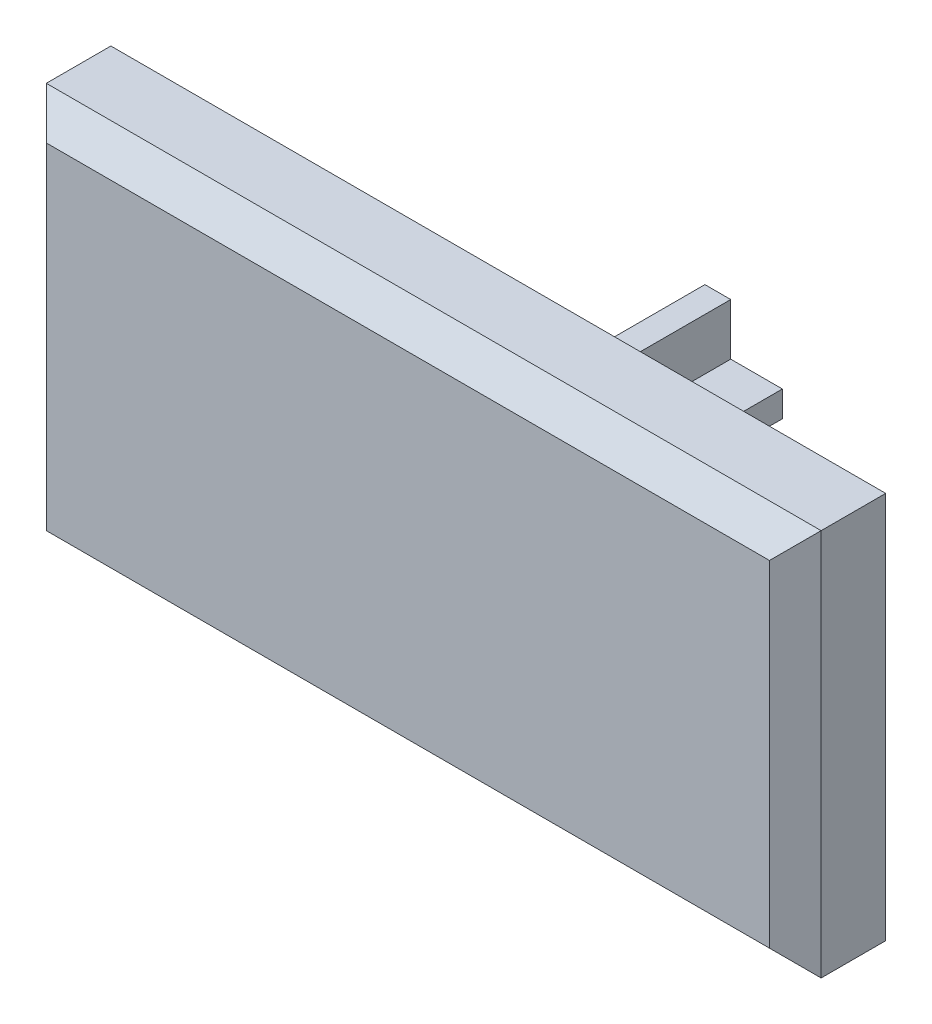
ISO-10303-21;
HEADER;
FILE_DESCRIPTION(('STEP AP214'),'2;1');
FILE_NAME('part.step','',(''),(''),'','','');
FILE_SCHEMA(('AUTOMOTIVE_DESIGN { 1 0 10303 214 1 1 1 1 }'));
ENDSEC;
DATA;
#1=APPLICATION_CONTEXT('core data for automotive mechanical design processes');
#2=APPLICATION_PROTOCOL_DEFINITION('international standard','automotive_design',2000,#1);
#3=PRODUCT_CONTEXT('',#1,'mechanical');
#4=PRODUCT('Part','Part','',(#3));
#5=PRODUCT_RELATED_PRODUCT_CATEGORY('part','',(#4));
#6=PRODUCT_DEFINITION_FORMATION('','',#4);
#7=PRODUCT_DEFINITION_CONTEXT('part definition',#1,'design');
#8=PRODUCT_DEFINITION('design','',#6,#7);
#9=PRODUCT_DEFINITION_SHAPE('','',#8);
#10=(LENGTH_UNIT() NAMED_UNIT(*) SI_UNIT(.MILLI.,.METRE.));
#11=(NAMED_UNIT(*) PLANE_ANGLE_UNIT() SI_UNIT($,.RADIAN.));
#12=(NAMED_UNIT(*) SI_UNIT($,.STERADIAN.) SOLID_ANGLE_UNIT());
#13=UNCERTAINTY_MEASURE_WITH_UNIT(LENGTH_MEASURE(1.E-05),#10,'distance_accuracy_value','');
#14=(GEOMETRIC_REPRESENTATION_CONTEXT(3) GLOBAL_UNCERTAINTY_ASSIGNED_CONTEXT((#13)) GLOBAL_UNIT_ASSIGNED_CONTEXT((#10,
#11,#12)) REPRESENTATION_CONTEXT('',''));
#15=CARTESIAN_POINT('',(0.,0.,0.));
#16=DIRECTION('',(0.,0.,1.));
#17=DIRECTION('',(1.,0.,0.));
#18=AXIS2_PLACEMENT_3D('',#15,#16,#17);
#19=CARTESIAN_POINT('',(0.,0.,-0.25));
#20=DIRECTION('',(0.,0.,1.));
#21=DIRECTION('',(1.,0.,0.));
#22=AXIS2_PLACEMENT_3D('',#19,#20,#21);
#23=PLANE('',#22);
#24=DIRECTION('',(0.,-1.,0.));
#25=VECTOR('',#24,1.);
#26=CARTESIAN_POINT('',(-13.,7.5,-0.25));
#27=LINE('',#26,#25);
#28=CARTESIAN_POINT('',(-13.,5.5,-0.25));
#29=VERTEX_POINT('',#28);
#30=CARTESIAN_POINT('',(-13.,-5.5,-0.25));
#31=VERTEX_POINT('',#30);
#32=EDGE_CURVE('E217',#29,#31,#27,.T.);
#33=ORIENTED_EDGE('',*,*,#32,.F.);
#34=DIRECTION('',(-1.,0.,0.));
#35=VECTOR('',#34,1.);
#36=CARTESIAN_POINT('',(-15.,5.5,-0.25));
#37=LINE('',#36,#35);
#38=CARTESIAN_POINT('',(13.,5.5,-0.25));
#39=VERTEX_POINT('',#38);
#40=EDGE_CURVE('E225',#39,#29,#37,.T.);
#41=ORIENTED_EDGE('',*,*,#40,.F.);
#42=DIRECTION('',(0.,1.,0.));
#43=VECTOR('',#42,1.);
#44=CARTESIAN_POINT('',(13.,7.5,-0.25));
#45=LINE('',#44,#43);
#46=CARTESIAN_POINT('',(13.,-5.5,-0.25));
#47=VERTEX_POINT('',#46);
#48=EDGE_CURVE('E229',#47,#39,#45,.T.);
#49=ORIENTED_EDGE('',*,*,#48,.F.);
#50=DIRECTION('',(1.,0.,0.));
#51=VECTOR('',#50,1.);
#52=CARTESIAN_POINT('',(-15.,-5.5,-0.25));
#53=LINE('',#52,#51);
#54=EDGE_CURVE('E220',#31,#47,#53,.T.);
#55=ORIENTED_EDGE('',*,*,#54,.F.);
#56=EDGE_LOOP('',(#33,#41,#49,#55));
#57=FACE_BOUND('',#56,.T.);
#58=DIRECTION('',(0.,-1.,0.));
#59=VECTOR('',#58,1.);
#60=CARTESIAN_POINT('',(2.5,0.5,-0.25));
#61=LINE('',#60,#59);
#62=CARTESIAN_POINT('',(2.5,0.5,-0.25));
#63=VERTEX_POINT('',#62);
#64=CARTESIAN_POINT('',(2.5,-0.5,-0.25));
#65=VERTEX_POINT('',#64);
#66=EDGE_CURVE('E203',#63,#65,#61,.T.);
#67=ORIENTED_EDGE('',*,*,#66,.F.);
#68=DIRECTION('',(1.,0.,0.));
#69=VECTOR('',#68,1.);
#70=CARTESIAN_POINT('',(2.5,0.5,-0.25));
#71=LINE('',#70,#69);
#72=CARTESIAN_POINT('',(0.5,0.5,-0.25));
#73=VERTEX_POINT('',#72);
#74=EDGE_CURVE('E200',#73,#63,#71,.T.);
#75=ORIENTED_EDGE('',*,*,#74,.F.);
#76=DIRECTION('',(0.,-1.,0.));
#77=VECTOR('',#76,1.);
#78=CARTESIAN_POINT('',(0.5,2.5,-0.25));
#79=LINE('',#78,#77);
#80=CARTESIAN_POINT('',(0.5,2.5,-0.25));
#81=VERTEX_POINT('',#80);
#82=EDGE_CURVE('E579',#81,#73,#79,.T.);
#83=ORIENTED_EDGE('',*,*,#82,.F.);
#84=DIRECTION('',(1.,0.,0.));
#85=VECTOR('',#84,1.);
#86=CARTESIAN_POINT('',(0.5,2.5,-0.25));
#87=LINE('',#86,#85);
#88=CARTESIAN_POINT('',(-0.5,2.5,-0.25));
#89=VERTEX_POINT('',#88);
#90=EDGE_CURVE('E634',#89,#81,#87,.T.);
#91=ORIENTED_EDGE('',*,*,#90,.F.);
#92=DIRECTION('',(0.,1.,0.));
#93=VECTOR('',#92,1.);
#94=CARTESIAN_POINT('',(-0.5,2.5,-0.25));
#95=LINE('',#94,#93);
#96=CARTESIAN_POINT('',(-0.5,0.5,-0.25));
#97=VERTEX_POINT('',#96);
#98=EDGE_CURVE('E631',#97,#89,#95,.T.);
#99=ORIENTED_EDGE('',*,*,#98,.F.);
#100=DIRECTION('',(1.,0.,0.));
#101=VECTOR('',#100,1.);
#102=CARTESIAN_POINT('',(-0.5,0.5,-0.25));
#103=LINE('',#102,#101);
#104=CARTESIAN_POINT('',(-2.5,0.5,-0.25));
#105=VERTEX_POINT('',#104);
#106=EDGE_CURVE('E628',#105,#97,#103,.T.);
#107=ORIENTED_EDGE('',*,*,#106,.F.);
#108=DIRECTION('',(0.,1.,0.));
#109=VECTOR('',#108,1.);
#110=CARTESIAN_POINT('',(-2.5,0.5,-0.25));
#111=LINE('',#110,#109);
#112=CARTESIAN_POINT('',(-2.5,-0.5,-0.25));
#113=VERTEX_POINT('',#112);
#114=EDGE_CURVE('E625',#113,#105,#111,.T.);
#115=ORIENTED_EDGE('',*,*,#114,.F.);
#116=DIRECTION('',(-1.,0.,0.));
#117=VECTOR('',#116,1.);
#118=CARTESIAN_POINT('',(-0.5,-0.5,-0.25));
#119=LINE('',#118,#117);
#120=CARTESIAN_POINT('',(-0.5,-0.5,-0.25));
#121=VERTEX_POINT('',#120);
#122=EDGE_CURVE('E622',#121,#113,#119,.T.);
#123=ORIENTED_EDGE('',*,*,#122,.F.);
#124=DIRECTION('',(0.,1.,0.));
#125=VECTOR('',#124,1.);
#126=CARTESIAN_POINT('',(-0.5,-0.5,-0.25));
#127=LINE('',#126,#125);
#128=CARTESIAN_POINT('',(-0.5,-2.5,-0.25));
#129=VERTEX_POINT('',#128);
#130=EDGE_CURVE('E615',#129,#121,#127,.T.);
#131=ORIENTED_EDGE('',*,*,#130,.F.);
#132=DIRECTION('',(-1.,0.,0.));
#133=VECTOR('',#132,1.);
#134=CARTESIAN_POINT('',(0.5,-2.5,-0.25));
#135=LINE('',#134,#133);
#136=CARTESIAN_POINT('',(0.5,-2.5,-0.25));
#137=VERTEX_POINT('',#136);
#138=EDGE_CURVE('E612',#137,#129,#135,.T.);
#139=ORIENTED_EDGE('',*,*,#138,.F.);
#140=DIRECTION('',(0.,-1.,0.));
#141=VECTOR('',#140,1.);
#142=CARTESIAN_POINT('',(0.5,-0.5,-0.25));
#143=LINE('',#142,#141);
#144=CARTESIAN_POINT('',(0.5,-0.5,-0.25));
#145=VERTEX_POINT('',#144);
#146=EDGE_CURVE('E55',#145,#137,#143,.T.);
#147=ORIENTED_EDGE('',*,*,#146,.F.);
#148=DIRECTION('',(-1.,0.,0.));
#149=VECTOR('',#148,1.);
#150=CARTESIAN_POINT('',(2.5,-0.5,-0.25));
#151=LINE('',#150,#149);
#152=EDGE_CURVE('E50',#65,#145,#151,.T.);
#153=ORIENTED_EDGE('',*,*,#152,.F.);
#154=EDGE_LOOP('',(#67,#75,#83,#91,#99,#107,#115,#123,#131,#139,#147,#153));
#155=FACE_BOUND('',#154,.T.);
#156=ADVANCED_FACE('F33',(#57,#155),#23,.F.);
#157=CARTESIAN_POINT('',(-15.,7.5,1.75));
#158=DIRECTION('',(1.,0.,0.));
#159=DIRECTION('',(0.,1.,0.));
#160=AXIS2_PLACEMENT_3D('',#157,#158,#159);
#161=PLANE('',#160);
#162=DIRECTION('',(0.,0.,-1.));
#163=VECTOR('',#162,1.);
#164=CARTESIAN_POINT('',(-15.,-7.5,1.75));
#165=LINE('',#164,#163);
#166=CARTESIAN_POINT('',(-15.,-7.5,0.749999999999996));
#167=VERTEX_POINT('',#166);
#168=CARTESIAN_POINT('',(-15.,-7.5,-1.75));
#169=VERTEX_POINT('',#168);
#170=EDGE_CURVE('E261',#167,#169,#165,.T.);
#171=ORIENTED_EDGE('',*,*,#170,.F.);
#172=DIRECTION('',(0.,1.,0.));
#173=VECTOR('',#172,1.);
#174=CARTESIAN_POINT('',(-15.,7.5,0.749999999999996));
#175=LINE('',#174,#173);
#176=CARTESIAN_POINT('',(-15.,7.5,0.749999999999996));
#177=VERTEX_POINT('',#176);
#178=EDGE_CURVE('E42',#167,#177,#175,.T.);
#179=ORIENTED_EDGE('',*,*,#178,.T.);
#180=DIRECTION('',(0.,0.,-1.));
#181=VECTOR('',#180,1.);
#182=CARTESIAN_POINT('',(-15.,7.5,1.75));
#183=LINE('',#182,#181);
#184=CARTESIAN_POINT('',(-15.,7.5,-1.75));
#185=VERTEX_POINT('',#184);
#186=EDGE_CURVE('E255',#177,#185,#183,.T.);
#187=ORIENTED_EDGE('',*,*,#186,.T.);
#188=DIRECTION('',(0.,-1.,0.));
#189=VECTOR('',#188,1.);
#190=CARTESIAN_POINT('',(-15.,7.5,-1.75));
#191=LINE('',#190,#189);
#192=EDGE_CURVE('E215',#185,#169,#191,.T.);
#193=ORIENTED_EDGE('',*,*,#192,.T.);
#194=EDGE_LOOP('',(#171,#179,#187,#193));
#195=FACE_BOUND('',#194,.T.);
#196=ADVANCED_FACE('F297',(#195),#161,.F.);
#197=CARTESIAN_POINT('',(-15.,-7.5,1.75));
#198=DIRECTION('',(0.,1.,0.));
#199=DIRECTION('',(0.,0.,1.));
#200=AXIS2_PLACEMENT_3D('',#197,#198,#199);
#201=PLANE('',#200);
#202=DIRECTION('',(0.,0.,-1.));
#203=VECTOR('',#202,1.);
#204=CARTESIAN_POINT('',(15.,-7.5,1.75));
#205=LINE('',#204,#203);
#206=CARTESIAN_POINT('',(15.,-7.5,0.749999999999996));
#207=VERTEX_POINT('',#206);
#208=CARTESIAN_POINT('',(15.,-7.5,-1.75));
#209=VERTEX_POINT('',#208);
#210=EDGE_CURVE('E259',#207,#209,#205,.T.);
#211=ORIENTED_EDGE('',*,*,#210,.F.);
#212=DIRECTION('',(-1.,0.,0.));
#213=VECTOR('',#212,1.);
#214=CARTESIAN_POINT('',(-15.,-7.5,0.749999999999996));
#215=LINE('',#214,#213);
#216=EDGE_CURVE('E275',#207,#167,#215,.T.);
#217=ORIENTED_EDGE('',*,*,#216,.T.);
#218=ORIENTED_EDGE('',*,*,#170,.T.);
#219=DIRECTION('',(1.,0.,0.));
#220=VECTOR('',#219,1.);
#221=CARTESIAN_POINT('',(-15.,-7.5,-1.75));
#222=LINE('',#221,#220);
#223=EDGE_CURVE('E246',#169,#209,#222,.T.);
#224=ORIENTED_EDGE('',*,*,#223,.T.);
#225=EDGE_LOOP('',(#211,#217,#218,#224));
#226=FACE_BOUND('',#225,.T.);
#227=ADVANCED_FACE('F309',(#226),#201,.F.);
#228=CARTESIAN_POINT('',(15.,7.5,1.75));
#229=DIRECTION('',(-1.,0.,0.));
#230=DIRECTION('',(0.,-1.,0.));
#231=AXIS2_PLACEMENT_3D('',#228,#229,#230);
#232=PLANE('',#231);
#233=DIRECTION('',(0.,0.,-1.));
#234=VECTOR('',#233,1.);
#235=CARTESIAN_POINT('',(15.,7.5,1.75));
#236=LINE('',#235,#234);
#237=CARTESIAN_POINT('',(15.,7.5,0.749999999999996));
#238=VERTEX_POINT('',#237);
#239=CARTESIAN_POINT('',(15.,7.5,-1.75));
#240=VERTEX_POINT('',#239);
#241=EDGE_CURVE('E257',#238,#240,#236,.T.);
#242=ORIENTED_EDGE('',*,*,#241,.F.);
#243=DIRECTION('',(0.,-1.,0.));
#244=VECTOR('',#243,1.);
#245=CARTESIAN_POINT('',(15.,-7.5,0.749999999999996));
#246=LINE('',#245,#244);
#247=EDGE_CURVE('E272',#238,#207,#246,.T.);
#248=ORIENTED_EDGE('',*,*,#247,.T.);
#249=ORIENTED_EDGE('',*,*,#210,.T.);
#250=DIRECTION('',(0.,1.,0.));
#251=VECTOR('',#250,1.);
#252=CARTESIAN_POINT('',(15.,7.5,-1.75));
#253=LINE('',#252,#251);
#254=EDGE_CURVE('E249',#209,#240,#253,.T.);
#255=ORIENTED_EDGE('',*,*,#254,.T.);
#256=EDGE_LOOP('',(#242,#248,#249,#255));
#257=FACE_BOUND('',#256,.T.);
#258=ADVANCED_FACE('F311',(#257),#232,.F.);
#259=CARTESIAN_POINT('',(-15.,7.5,1.75));
#260=DIRECTION('',(0.,-1.,0.));
#261=DIRECTION('',(1.,0.,0.));
#262=AXIS2_PLACEMENT_3D('',#259,#260,#261);
#263=PLANE('',#262);
#264=ORIENTED_EDGE('',*,*,#186,.F.);
#265=DIRECTION('',(1.,0.,0.));
#266=VECTOR('',#265,1.);
#267=CARTESIAN_POINT('',(15.,7.5,0.749999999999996));
#268=LINE('',#267,#266);
#269=EDGE_CURVE('E11',#177,#238,#268,.T.);
#270=ORIENTED_EDGE('',*,*,#269,.T.);
#271=ORIENTED_EDGE('',*,*,#241,.T.);
#272=DIRECTION('',(-1.,0.,0.));
#273=VECTOR('',#272,1.);
#274=CARTESIAN_POINT('',(-15.,7.5,-1.75));
#275=LINE('',#274,#273);
#276=EDGE_CURVE('E252',#240,#185,#275,.T.);
#277=ORIENTED_EDGE('',*,*,#276,.T.);
#278=EDGE_LOOP('',(#264,#270,#271,#277));
#279=FACE_BOUND('',#278,.T.);
#280=ADVANCED_FACE('F299',(#279),#263,.F.);
#281=CARTESIAN_POINT('',(0.,0.,1.75));
#282=DIRECTION('',(0.,0.,1.));
#283=DIRECTION('',(1.,0.,0.));
#284=AXIS2_PLACEMENT_3D('',#281,#282,#283);
#285=PLANE('',#284);
#286=DIRECTION('',(1.,0.,0.));
#287=VECTOR('',#286,1.);
#288=CARTESIAN_POINT('',(15.,-6.5,1.75));
#289=LINE('',#288,#287);
#290=CARTESIAN_POINT('',(-14.,-6.5,1.75));
#291=VERTEX_POINT('',#290);
#292=CARTESIAN_POINT('',(14.,-6.5,1.75));
#293=VERTEX_POINT('',#292);
#294=EDGE_CURVE('E267',#291,#293,#289,.T.);
#295=ORIENTED_EDGE('',*,*,#294,.T.);
#296=DIRECTION('',(0.,1.,0.));
#297=VECTOR('',#296,1.);
#298=CARTESIAN_POINT('',(14.,7.5,1.75));
#299=LINE('',#298,#297);
#300=CARTESIAN_POINT('',(14.,6.5,1.75));
#301=VERTEX_POINT('',#300);
#302=EDGE_CURVE('E269',#293,#301,#299,.T.);
#303=ORIENTED_EDGE('',*,*,#302,.T.);
#304=DIRECTION('',(-1.,0.,0.));
#305=VECTOR('',#304,1.);
#306=CARTESIAN_POINT('',(-15.,6.5,1.75));
#307=LINE('',#306,#305);
#308=CARTESIAN_POINT('',(-14.,6.5,1.75));
#309=VERTEX_POINT('',#308);
#310=EDGE_CURVE('E263',#301,#309,#307,.T.);
#311=ORIENTED_EDGE('',*,*,#310,.T.);
#312=DIRECTION('',(0.,-1.,0.));
#313=VECTOR('',#312,1.);
#314=CARTESIAN_POINT('',(-14.,-7.5,1.75));
#315=LINE('',#314,#313);
#316=EDGE_CURVE('E265',#309,#291,#315,.T.);
#317=ORIENTED_EDGE('',*,*,#316,.T.);
#318=EDGE_LOOP('',(#295,#303,#311,#317));
#319=FACE_BOUND('',#318,.T.);
#320=ADVANCED_FACE('F319',(#319),#285,.T.);
#321=CARTESIAN_POINT('',(0.,0.,-1.75));
#322=DIRECTION('',(0.,0.,1.));
#323=DIRECTION('',(1.,0.,0.));
#324=AXIS2_PLACEMENT_3D('',#321,#322,#323);
#325=PLANE('',#324);
#326=DIRECTION('',(-1.,0.,0.));
#327=VECTOR('',#326,1.);
#328=CARTESIAN_POINT('',(-15.,5.5,-1.75));
#329=LINE('',#328,#327);
#330=CARTESIAN_POINT('',(13.,5.5,-1.75));
#331=VERTEX_POINT('',#330);
#332=CARTESIAN_POINT('',(-13.,5.5,-1.75));
#333=VERTEX_POINT('',#332);
#334=EDGE_CURVE('E221',#331,#333,#329,.T.);
#335=ORIENTED_EDGE('',*,*,#334,.T.);
#336=DIRECTION('',(0.,-1.,0.));
#337=VECTOR('',#336,1.);
#338=CARTESIAN_POINT('',(-13.,7.5,-1.75));
#339=LINE('',#338,#337);
#340=CARTESIAN_POINT('',(-13.,-5.5,-1.75));
#341=VERTEX_POINT('',#340);
#342=EDGE_CURVE('E233',#333,#341,#339,.T.);
#343=ORIENTED_EDGE('',*,*,#342,.T.);
#344=DIRECTION('',(1.,0.,0.));
#345=VECTOR('',#344,1.);
#346=CARTESIAN_POINT('',(-15.,-5.5,-1.75));
#347=LINE('',#346,#345);
#348=CARTESIAN_POINT('',(13.,-5.5,-1.75));
#349=VERTEX_POINT('',#348);
#350=EDGE_CURVE('E236',#341,#349,#347,.T.);
#351=ORIENTED_EDGE('',*,*,#350,.T.);
#352=DIRECTION('',(0.,1.,0.));
#353=VECTOR('',#352,1.);
#354=CARTESIAN_POINT('',(13.,7.5,-1.75));
#355=LINE('',#354,#353);
#356=EDGE_CURVE('E239',#349,#331,#355,.T.);
#357=ORIENTED_EDGE('',*,*,#356,.T.);
#358=EDGE_LOOP('',(#335,#343,#351,#357));
#359=FACE_BOUND('',#358,.T.);
#360=ORIENTED_EDGE('',*,*,#192,.F.);
#361=ORIENTED_EDGE('',*,*,#276,.F.);
#362=ORIENTED_EDGE('',*,*,#254,.F.);
#363=ORIENTED_EDGE('',*,*,#223,.F.);
#364=EDGE_LOOP('',(#360,#361,#362,#363));
#365=FACE_BOUND('',#364,.T.);
#366=ADVANCED_FACE('F306',(#359,#365),#325,.F.);
#367=CARTESIAN_POINT('',(-13.,7.5,1.75));
#368=DIRECTION('',(1.,0.,0.));
#369=DIRECTION('',(0.,1.,0.));
#370=AXIS2_PLACEMENT_3D('',#367,#368,#369);
#371=PLANE('',#370);
#372=ORIENTED_EDGE('',*,*,#342,.F.);
#373=DIRECTION('',(0.,0.,-1.));
#374=VECTOR('',#373,1.);
#375=CARTESIAN_POINT('',(-13.,5.5,1.75));
#376=LINE('',#375,#374);
#377=EDGE_CURVE('E222',#29,#333,#376,.T.);
#378=ORIENTED_EDGE('',*,*,#377,.F.);
#379=ORIENTED_EDGE('',*,*,#32,.T.);
#380=DIRECTION('',(0.,0.,-1.));
#381=VECTOR('',#380,1.);
#382=CARTESIAN_POINT('',(-13.,-5.5,1.75));
#383=LINE('',#382,#381);
#384=EDGE_CURVE('E212',#31,#341,#383,.T.);
#385=ORIENTED_EDGE('',*,*,#384,.T.);
#386=EDGE_LOOP('',(#372,#378,#379,#385));
#387=FACE_BOUND('',#386,.T.);
#388=ADVANCED_FACE('F326',(#387),#371,.T.);
#389=CARTESIAN_POINT('',(-15.,-5.5,1.75));
#390=DIRECTION('',(0.,1.,0.));
#391=DIRECTION('',(0.,0.,1.));
#392=AXIS2_PLACEMENT_3D('',#389,#390,#391);
#393=PLANE('',#392);
#394=ORIENTED_EDGE('',*,*,#350,.F.);
#395=ORIENTED_EDGE('',*,*,#384,.F.);
#396=ORIENTED_EDGE('',*,*,#54,.T.);
#397=DIRECTION('',(0.,0.,-1.));
#398=VECTOR('',#397,1.);
#399=CARTESIAN_POINT('',(13.,-5.5,1.75));
#400=LINE('',#399,#398);
#401=EDGE_CURVE('E216',#47,#349,#400,.T.);
#402=ORIENTED_EDGE('',*,*,#401,.T.);
#403=EDGE_LOOP('',(#394,#395,#396,#402));
#404=FACE_BOUND('',#403,.T.);
#405=ADVANCED_FACE('F346',(#404),#393,.T.);
#406=CARTESIAN_POINT('',(13.,7.5,1.75));
#407=DIRECTION('',(-1.,0.,0.));
#408=DIRECTION('',(0.,-1.,0.));
#409=AXIS2_PLACEMENT_3D('',#406,#407,#408);
#410=PLANE('',#409);
#411=ORIENTED_EDGE('',*,*,#356,.F.);
#412=ORIENTED_EDGE('',*,*,#401,.F.);
#413=ORIENTED_EDGE('',*,*,#48,.T.);
#414=DIRECTION('',(0.,0.,-1.));
#415=VECTOR('',#414,1.);
#416=CARTESIAN_POINT('',(13.,5.5,1.75));
#417=LINE('',#416,#415);
#418=EDGE_CURVE('E224',#39,#331,#417,.T.);
#419=ORIENTED_EDGE('',*,*,#418,.T.);
#420=EDGE_LOOP('',(#411,#412,#413,#419));
#421=FACE_BOUND('',#420,.T.);
#422=ADVANCED_FACE('F342',(#421),#410,.T.);
#423=CARTESIAN_POINT('',(-15.,5.5,1.75));
#424=DIRECTION('',(0.,-1.,0.));
#425=DIRECTION('',(1.,0.,0.));
#426=AXIS2_PLACEMENT_3D('',#423,#424,#425);
#427=PLANE('',#426);
#428=ORIENTED_EDGE('',*,*,#334,.F.);
#429=ORIENTED_EDGE('',*,*,#418,.F.);
#430=ORIENTED_EDGE('',*,*,#40,.T.);
#431=ORIENTED_EDGE('',*,*,#377,.T.);
#432=EDGE_LOOP('',(#428,#429,#430,#431));
#433=FACE_BOUND('',#432,.T.);
#434=ADVANCED_FACE('F339',(#433),#427,.T.);
#435=CARTESIAN_POINT('',(-14.,0.,1.75));
#436=DIRECTION('',(-0.707106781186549,0.,0.707106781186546));
#437=DIRECTION('',(0.,1.,0.));
#438=AXIS2_PLACEMENT_3D('',#435,#436,#437);
#439=PLANE('',#438);
#440=DIRECTION('',(0.577350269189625,-0.577350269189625,0.577350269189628));
#441=VECTOR('',#440,1.);
#442=CARTESIAN_POINT('',(-9.33333333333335,1.83333333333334,6.41666666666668));
#443=LINE('',#442,#441);
#444=EDGE_CURVE('E278',#177,#309,#443,.T.);
#445=ORIENTED_EDGE('',*,*,#444,.F.);
#446=ORIENTED_EDGE('',*,*,#178,.F.);
#447=DIRECTION('',(0.577350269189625,0.577350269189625,0.577350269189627));
#448=VECTOR('',#447,1.);
#449=CARTESIAN_POINT('',(-11.8333333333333,-4.33333333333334,3.91666666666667));
#450=LINE('',#449,#448);
#451=EDGE_CURVE('E37',#291,#167,#450,.F.);
#452=ORIENTED_EDGE('',*,*,#451,.F.);
#453=ORIENTED_EDGE('',*,*,#316,.F.);
#454=EDGE_LOOP('',(#445,#446,#452,#453));
#455=FACE_BOUND('',#454,.T.);
#456=ADVANCED_FACE('F35',(#455),#439,.T.);
#457=CARTESIAN_POINT('',(0.,-6.5,1.75));
#458=DIRECTION('',(0.,-0.707106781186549,0.707106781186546));
#459=DIRECTION('',(-1.,0.,0.));
#460=AXIS2_PLACEMENT_3D('',#457,#458,#459);
#461=PLANE('',#460);
#462=ORIENTED_EDGE('',*,*,#451,.T.);
#463=ORIENTED_EDGE('',*,*,#216,.F.);
#464=DIRECTION('',(-0.577350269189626,0.577350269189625,0.577350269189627));
#465=VECTOR('',#464,1.);
#466=CARTESIAN_POINT('',(9.33333333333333,-1.83333333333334,6.41666666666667));
#467=LINE('',#466,#465);
#468=EDGE_CURVE('E206',#293,#207,#467,.F.);
#469=ORIENTED_EDGE('',*,*,#468,.F.);
#470=ORIENTED_EDGE('',*,*,#294,.F.);
#471=EDGE_LOOP('',(#462,#463,#469,#470));
#472=FACE_BOUND('',#471,.T.);
#473=ADVANCED_FACE('F289',(#472),#461,.T.);
#474=CARTESIAN_POINT('',(0.,6.5,1.75));
#475=DIRECTION('',(0.,0.707106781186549,0.707106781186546));
#476=DIRECTION('',(1.,0.,0.));
#477=AXIS2_PLACEMENT_3D('',#474,#475,#476);
#478=PLANE('',#477);
#479=ORIENTED_EDGE('',*,*,#444,.T.);
#480=ORIENTED_EDGE('',*,*,#310,.F.);
#481=DIRECTION('',(0.577350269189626,0.577350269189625,-0.577350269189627));
#482=VECTOR('',#481,1.);
#483=CARTESIAN_POINT('',(9.33333333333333,1.83333333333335,6.41666666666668));
#484=LINE('',#483,#482);
#485=EDGE_CURVE('E204',#238,#301,#484,.F.);
#486=ORIENTED_EDGE('',*,*,#485,.F.);
#487=ORIENTED_EDGE('',*,*,#269,.F.);
#488=EDGE_LOOP('',(#479,#480,#486,#487));
#489=FACE_BOUND('',#488,.T.);
#490=ADVANCED_FACE('F317',(#489),#478,.T.);
#491=CARTESIAN_POINT('',(14.,0.,1.75));
#492=DIRECTION('',(0.707106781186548,0.,0.707106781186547));
#493=DIRECTION('',(0.,-1.,0.));
#494=AXIS2_PLACEMENT_3D('',#491,#492,#493);
#495=PLANE('',#494);
#496=ORIENTED_EDGE('',*,*,#468,.T.);
#497=ORIENTED_EDGE('',*,*,#247,.F.);
#498=ORIENTED_EDGE('',*,*,#485,.T.);
#499=ORIENTED_EDGE('',*,*,#302,.F.);
#500=EDGE_LOOP('',(#496,#497,#498,#499));
#501=FACE_BOUND('',#500,.T.);
#502=ADVANCED_FACE('F315',(#501),#495,.T.);
#503=CARTESIAN_POINT('',(2.5,0.5,-10.25));
#504=DIRECTION('',(-1.,0.,0.));
#505=DIRECTION('',(0.,0.,1.));
#506=AXIS2_PLACEMENT_3D('',#503,#504,#505);
#507=PLANE('',#506);
#508=ORIENTED_EDGE('',*,*,#66,.T.);
#509=DIRECTION('',(0.,0.,1.));
#510=VECTOR('',#509,1.);
#511=CARTESIAN_POINT('',(2.5,-0.5,-10.25));
#512=LINE('',#511,#510);
#513=CARTESIAN_POINT('',(2.5,-0.5,-10.25));
#514=VERTEX_POINT('',#513);
#515=EDGE_CURVE('E184',#514,#65,#512,.T.);
#516=ORIENTED_EDGE('',*,*,#515,.F.);
#517=DIRECTION('',(0.,-1.,0.));
#518=VECTOR('',#517,1.);
#519=CARTESIAN_POINT('',(2.5,0.5,-10.25));
#520=LINE('',#519,#518);
#521=CARTESIAN_POINT('',(2.5,0.5,-10.25));
#522=VERTEX_POINT('',#521);
#523=EDGE_CURVE('E191',#522,#514,#520,.T.);
#524=ORIENTED_EDGE('',*,*,#523,.F.);
#525=DIRECTION('',(0.,0.,1.));
#526=VECTOR('',#525,1.);
#527=CARTESIAN_POINT('',(2.5,0.5,-10.25));
#528=LINE('',#527,#526);
#529=EDGE_CURVE('E575',#522,#63,#528,.T.);
#530=ORIENTED_EDGE('',*,*,#529,.T.);
#531=EDGE_LOOP('',(#508,#516,#524,#530));
#532=FACE_BOUND('',#531,.T.);
#533=ADVANCED_FACE('F202',(#532),#507,.F.);
#534=CARTESIAN_POINT('',(2.5,-0.5,-10.25));
#535=DIRECTION('',(0.,1.,0.));
#536=DIRECTION('',(0.,0.,1.));
#537=AXIS2_PLACEMENT_3D('',#534,#535,#536);
#538=PLANE('',#537);
#539=ORIENTED_EDGE('',*,*,#152,.T.);
#540=DIRECTION('',(0.,0.,1.));
#541=VECTOR('',#540,1.);
#542=CARTESIAN_POINT('',(0.5,-0.5,-10.25));
#543=LINE('',#542,#541);
#544=CARTESIAN_POINT('',(0.5,-0.5,-10.25));
#545=VERTEX_POINT('',#544);
#546=EDGE_CURVE('E187',#545,#145,#543,.T.);
#547=ORIENTED_EDGE('',*,*,#546,.F.);
#548=DIRECTION('',(-1.,0.,0.));
#549=VECTOR('',#548,1.);
#550=CARTESIAN_POINT('',(2.5,-0.5,-10.25));
#551=LINE('',#550,#549);
#552=EDGE_CURVE('E180',#514,#545,#551,.T.);
#553=ORIENTED_EDGE('',*,*,#552,.F.);
#554=ORIENTED_EDGE('',*,*,#515,.T.);
#555=EDGE_LOOP('',(#539,#547,#553,#554));
#556=FACE_BOUND('',#555,.T.);
#557=ADVANCED_FACE('F182',(#556),#538,.F.);
#558=CARTESIAN_POINT('',(0.5,-0.5,-10.25));
#559=DIRECTION('',(-1.,0.,0.));
#560=DIRECTION('',(0.,-1.,0.));
#561=AXIS2_PLACEMENT_3D('',#558,#559,#560);
#562=PLANE('',#561);
#563=ORIENTED_EDGE('',*,*,#146,.T.);
#564=DIRECTION('',(0.,0.,1.));
#565=VECTOR('',#564,1.);
#566=CARTESIAN_POINT('',(0.5,-2.5,-10.25));
#567=LINE('',#566,#565);
#568=CARTESIAN_POINT('',(0.5,-2.5,-10.25));
#569=VERTEX_POINT('',#568);
#570=EDGE_CURVE('E208',#569,#137,#567,.T.);
#571=ORIENTED_EDGE('',*,*,#570,.F.);
#572=DIRECTION('',(0.,-1.,0.));
#573=VECTOR('',#572,1.);
#574=CARTESIAN_POINT('',(0.5,-0.5,-10.25));
#575=LINE('',#574,#573);
#576=EDGE_CURVE('E190',#545,#569,#575,.T.);
#577=ORIENTED_EDGE('',*,*,#576,.F.);
#578=ORIENTED_EDGE('',*,*,#546,.T.);
#579=EDGE_LOOP('',(#563,#571,#577,#578));
#580=FACE_BOUND('',#579,.T.);
#581=ADVANCED_FACE('F358',(#580),#562,.F.);
#582=CARTESIAN_POINT('',(0.5,-2.5,-10.25));
#583=DIRECTION('',(0.,1.,0.));
#584=DIRECTION('',(0.,0.,1.));
#585=AXIS2_PLACEMENT_3D('',#582,#583,#584);
#586=PLANE('',#585);
#587=ORIENTED_EDGE('',*,*,#138,.T.);
#588=DIRECTION('',(0.,0.,1.));
#589=VECTOR('',#588,1.);
#590=CARTESIAN_POINT('',(-0.5,-2.5,-10.25));
#591=LINE('',#590,#589);
#592=CARTESIAN_POINT('',(-0.5,-2.5,-10.25));
#593=VERTEX_POINT('',#592);
#594=EDGE_CURVE('E605',#593,#129,#591,.T.);
#595=ORIENTED_EDGE('',*,*,#594,.F.);
#596=DIRECTION('',(-1.,0.,0.));
#597=VECTOR('',#596,1.);
#598=CARTESIAN_POINT('',(0.5,-2.5,-10.25));
#599=LINE('',#598,#597);
#600=EDGE_CURVE('E613',#569,#593,#599,.T.);
#601=ORIENTED_EDGE('',*,*,#600,.F.);
#602=ORIENTED_EDGE('',*,*,#570,.T.);
#603=EDGE_LOOP('',(#587,#595,#601,#602));
#604=FACE_BOUND('',#603,.T.);
#605=ADVANCED_FACE('F361',(#604),#586,.F.);
#606=CARTESIAN_POINT('',(-0.5,-0.5,-10.25));
#607=DIRECTION('',(1.,0.,0.));
#608=DIRECTION('',(0.,1.,0.));
#609=AXIS2_PLACEMENT_3D('',#606,#607,#608);
#610=PLANE('',#609);
#611=ORIENTED_EDGE('',*,*,#130,.T.);
#612=DIRECTION('',(0.,0.,1.));
#613=VECTOR('',#612,1.);
#614=CARTESIAN_POINT('',(-0.5,-0.5,-10.25));
#615=LINE('',#614,#613);
#616=CARTESIAN_POINT('',(-0.5,-0.5,-10.25));
#617=VERTEX_POINT('',#616);
#618=EDGE_CURVE('E602',#617,#121,#615,.T.);
#619=ORIENTED_EDGE('',*,*,#618,.F.);
#620=DIRECTION('',(0.,1.,0.));
#621=VECTOR('',#620,1.);
#622=CARTESIAN_POINT('',(-0.5,-0.5,-10.25));
#623=LINE('',#622,#621);
#624=EDGE_CURVE('E654',#593,#617,#623,.T.);
#625=ORIENTED_EDGE('',*,*,#624,.F.);
#626=ORIENTED_EDGE('',*,*,#594,.T.);
#627=EDGE_LOOP('',(#611,#619,#625,#626));
#628=FACE_BOUND('',#627,.T.);
#629=ADVANCED_FACE('F365',(#628),#610,.F.);
#630=CARTESIAN_POINT('',(-0.5,-0.5,-10.25));
#631=DIRECTION('',(0.,1.,0.));
#632=DIRECTION('',(0.,0.,1.));
#633=AXIS2_PLACEMENT_3D('',#630,#631,#632);
#634=PLANE('',#633);
#635=ORIENTED_EDGE('',*,*,#122,.T.);
#636=DIRECTION('',(0.,0.,1.));
#637=VECTOR('',#636,1.);
#638=CARTESIAN_POINT('',(-2.5,-0.5,-10.25));
#639=LINE('',#638,#637);
#640=CARTESIAN_POINT('',(-2.5,-0.5,-10.25));
#641=VERTEX_POINT('',#640);
#642=EDGE_CURVE('E599',#641,#113,#639,.T.);
#643=ORIENTED_EDGE('',*,*,#642,.F.);
#644=DIRECTION('',(-1.,0.,0.));
#645=VECTOR('',#644,1.);
#646=CARTESIAN_POINT('',(-0.5,-0.5,-10.25));
#647=LINE('',#646,#645);
#648=EDGE_CURVE('E652',#617,#641,#647,.T.);
#649=ORIENTED_EDGE('',*,*,#648,.F.);
#650=ORIENTED_EDGE('',*,*,#618,.T.);
#651=EDGE_LOOP('',(#635,#643,#649,#650));
#652=FACE_BOUND('',#651,.T.);
#653=ADVANCED_FACE('F369',(#652),#634,.F.);
#654=CARTESIAN_POINT('',(-2.5,0.5,-10.25));
#655=DIRECTION('',(1.,0.,0.));
#656=DIRECTION('',(0.,1.,0.));
#657=AXIS2_PLACEMENT_3D('',#654,#655,#656);
#658=PLANE('',#657);
#659=ORIENTED_EDGE('',*,*,#114,.T.);
#660=DIRECTION('',(0.,0.,1.));
#661=VECTOR('',#660,1.);
#662=CARTESIAN_POINT('',(-2.5,0.5,-10.25));
#663=LINE('',#662,#661);
#664=CARTESIAN_POINT('',(-2.5,0.5,-10.25));
#665=VERTEX_POINT('',#664);
#666=EDGE_CURVE('E596',#665,#105,#663,.T.);
#667=ORIENTED_EDGE('',*,*,#666,.F.);
#668=DIRECTION('',(0.,1.,0.));
#669=VECTOR('',#668,1.);
#670=CARTESIAN_POINT('',(-2.5,0.5,-10.25));
#671=LINE('',#670,#669);
#672=EDGE_CURVE('E648',#641,#665,#671,.T.);
#673=ORIENTED_EDGE('',*,*,#672,.F.);
#674=ORIENTED_EDGE('',*,*,#642,.T.);
#675=EDGE_LOOP('',(#659,#667,#673,#674));
#676=FACE_BOUND('',#675,.T.);
#677=ADVANCED_FACE('F373',(#676),#658,.F.);
#678=CARTESIAN_POINT('',(-0.5,0.5,-10.25));
#679=DIRECTION('',(0.,-1.,0.));
#680=DIRECTION('',(0.,0.,-1.));
#681=AXIS2_PLACEMENT_3D('',#678,#679,#680);
#682=PLANE('',#681);
#683=ORIENTED_EDGE('',*,*,#106,.T.);
#684=DIRECTION('',(0.,0.,1.));
#685=VECTOR('',#684,1.);
#686=CARTESIAN_POINT('',(-0.5,0.5,-10.25));
#687=LINE('',#686,#685);
#688=CARTESIAN_POINT('',(-0.5,0.5,-10.25));
#689=VERTEX_POINT('',#688);
#690=EDGE_CURVE('E593',#689,#97,#687,.T.);
#691=ORIENTED_EDGE('',*,*,#690,.F.);
#692=DIRECTION('',(1.,0.,0.));
#693=VECTOR('',#692,1.);
#694=CARTESIAN_POINT('',(-0.5,0.5,-10.25));
#695=LINE('',#694,#693);
#696=EDGE_CURVE('E646',#665,#689,#695,.T.);
#697=ORIENTED_EDGE('',*,*,#696,.F.);
#698=ORIENTED_EDGE('',*,*,#666,.T.);
#699=EDGE_LOOP('',(#683,#691,#697,#698));
#700=FACE_BOUND('',#699,.T.);
#701=ADVANCED_FACE('F377',(#700),#682,.F.);
#702=CARTESIAN_POINT('',(-0.5,2.5,-10.25));
#703=DIRECTION('',(1.,0.,0.));
#704=DIRECTION('',(0.,1.,0.));
#705=AXIS2_PLACEMENT_3D('',#702,#703,#704);
#706=PLANE('',#705);
#707=ORIENTED_EDGE('',*,*,#98,.T.);
#708=DIRECTION('',(0.,0.,1.));
#709=VECTOR('',#708,1.);
#710=CARTESIAN_POINT('',(-0.5,2.5,-10.25));
#711=LINE('',#710,#709);
#712=CARTESIAN_POINT('',(-0.5,2.5,-10.25));
#713=VERTEX_POINT('',#712);
#714=EDGE_CURVE('E590',#713,#89,#711,.T.);
#715=ORIENTED_EDGE('',*,*,#714,.F.);
#716=DIRECTION('',(0.,1.,0.));
#717=VECTOR('',#716,1.);
#718=CARTESIAN_POINT('',(-0.5,2.5,-10.25));
#719=LINE('',#718,#717);
#720=EDGE_CURVE('E642',#689,#713,#719,.T.);
#721=ORIENTED_EDGE('',*,*,#720,.F.);
#722=ORIENTED_EDGE('',*,*,#690,.T.);
#723=EDGE_LOOP('',(#707,#715,#721,#722));
#724=FACE_BOUND('',#723,.T.);
#725=ADVANCED_FACE('F381',(#724),#706,.F.);
#726=CARTESIAN_POINT('',(0.5,2.5,-10.25));
#727=DIRECTION('',(0.,-1.,0.));
#728=DIRECTION('',(0.,0.,-1.));
#729=AXIS2_PLACEMENT_3D('',#726,#727,#728);
#730=PLANE('',#729);
#731=ORIENTED_EDGE('',*,*,#90,.T.);
#732=DIRECTION('',(0.,0.,1.));
#733=VECTOR('',#732,1.);
#734=CARTESIAN_POINT('',(0.5,2.5,-10.25));
#735=LINE('',#734,#733);
#736=CARTESIAN_POINT('',(0.5,2.5,-10.25));
#737=VERTEX_POINT('',#736);
#738=EDGE_CURVE('E582',#737,#81,#735,.T.);
#739=ORIENTED_EDGE('',*,*,#738,.F.);
#740=DIRECTION('',(1.,0.,0.));
#741=VECTOR('',#740,1.);
#742=CARTESIAN_POINT('',(0.5,2.5,-10.25));
#743=LINE('',#742,#741);
#744=EDGE_CURVE('E640',#713,#737,#743,.T.);
#745=ORIENTED_EDGE('',*,*,#744,.F.);
#746=ORIENTED_EDGE('',*,*,#714,.T.);
#747=EDGE_LOOP('',(#731,#739,#745,#746));
#748=FACE_BOUND('',#747,.T.);
#749=ADVANCED_FACE('F385',(#748),#730,.F.);
#750=CARTESIAN_POINT('',(0.5,2.5,-10.25));
#751=DIRECTION('',(-1.,0.,0.));
#752=DIRECTION('',(0.,-1.,0.));
#753=AXIS2_PLACEMENT_3D('',#750,#751,#752);
#754=PLANE('',#753);
#755=ORIENTED_EDGE('',*,*,#82,.T.);
#756=DIRECTION('',(0.,0.,1.));
#757=VECTOR('',#756,1.);
#758=CARTESIAN_POINT('',(0.5,0.5,-10.25));
#759=LINE('',#758,#757);
#760=CARTESIAN_POINT('',(0.5,0.5,-10.25));
#761=VERTEX_POINT('',#760);
#762=EDGE_CURVE('E577',#761,#73,#759,.T.);
#763=ORIENTED_EDGE('',*,*,#762,.F.);
#764=DIRECTION('',(0.,-1.,0.));
#765=VECTOR('',#764,1.);
#766=CARTESIAN_POINT('',(0.5,2.5,-10.25));
#767=LINE('',#766,#765);
#768=EDGE_CURVE('E584',#737,#761,#767,.T.);
#769=ORIENTED_EDGE('',*,*,#768,.F.);
#770=ORIENTED_EDGE('',*,*,#738,.T.);
#771=EDGE_LOOP('',(#755,#763,#769,#770));
#772=FACE_BOUND('',#771,.T.);
#773=ADVANCED_FACE('F389',(#772),#754,.F.);
#774=CARTESIAN_POINT('',(2.5,0.5,-10.25));
#775=DIRECTION('',(0.,-1.,0.));
#776=DIRECTION('',(0.,0.,-1.));
#777=AXIS2_PLACEMENT_3D('',#774,#775,#776);
#778=PLANE('',#777);
#779=ORIENTED_EDGE('',*,*,#74,.T.);
#780=ORIENTED_EDGE('',*,*,#529,.F.);
#781=DIRECTION('',(1.,0.,0.));
#782=VECTOR('',#781,1.);
#783=CARTESIAN_POINT('',(2.5,0.5,-10.25));
#784=LINE('',#783,#782);
#785=EDGE_CURVE('E196',#761,#522,#784,.T.);
#786=ORIENTED_EDGE('',*,*,#785,.F.);
#787=ORIENTED_EDGE('',*,*,#762,.T.);
#788=EDGE_LOOP('',(#779,#780,#786,#787));
#789=FACE_BOUND('',#788,.T.);
#790=ADVANCED_FACE('F393',(#789),#778,.F.);
#791=CARTESIAN_POINT('',(0.,0.,-10.25));
#792=DIRECTION('',(0.,0.,-1.));
#793=DIRECTION('',(-1.,0.,0.));
#794=AXIS2_PLACEMENT_3D('',#791,#792,#793);
#795=PLANE('',#794);
#796=ORIENTED_EDGE('',*,*,#523,.T.);
#797=ORIENTED_EDGE('',*,*,#552,.T.);
#798=ORIENTED_EDGE('',*,*,#576,.T.);
#799=ORIENTED_EDGE('',*,*,#600,.T.);
#800=ORIENTED_EDGE('',*,*,#624,.T.);
#801=ORIENTED_EDGE('',*,*,#648,.T.);
#802=ORIENTED_EDGE('',*,*,#672,.T.);
#803=ORIENTED_EDGE('',*,*,#696,.T.);
#804=ORIENTED_EDGE('',*,*,#720,.T.);
#805=ORIENTED_EDGE('',*,*,#744,.T.);
#806=ORIENTED_EDGE('',*,*,#768,.T.);
#807=ORIENTED_EDGE('',*,*,#785,.T.);
#808=EDGE_LOOP('',(#796,#797,#798,#799,#800,#801,#802,#803,#804,#805,#806,#807));
#809=FACE_BOUND('',#808,.T.);
#810=ADVANCED_FACE('F194',(#809),#795,.T.);
#811=CLOSED_SHELL('',(#156,#196,#227,#258,#280,#320,#366,#388,#405,#422,#434,#456,#473,#490,
#502,#533,#557,#581,#605,#629,#653,#677,#701,#725,#749,#773,#790,#810));
#812=MANIFOLD_SOLID_BREP('B2',#811);
#813=ADVANCED_BREP_SHAPE_REPRESENTATION('',(#18,#812),#14);
#814=SHAPE_DEFINITION_REPRESENTATION(#9,#813);
ENDSEC;
END-ISO-10303-21;
